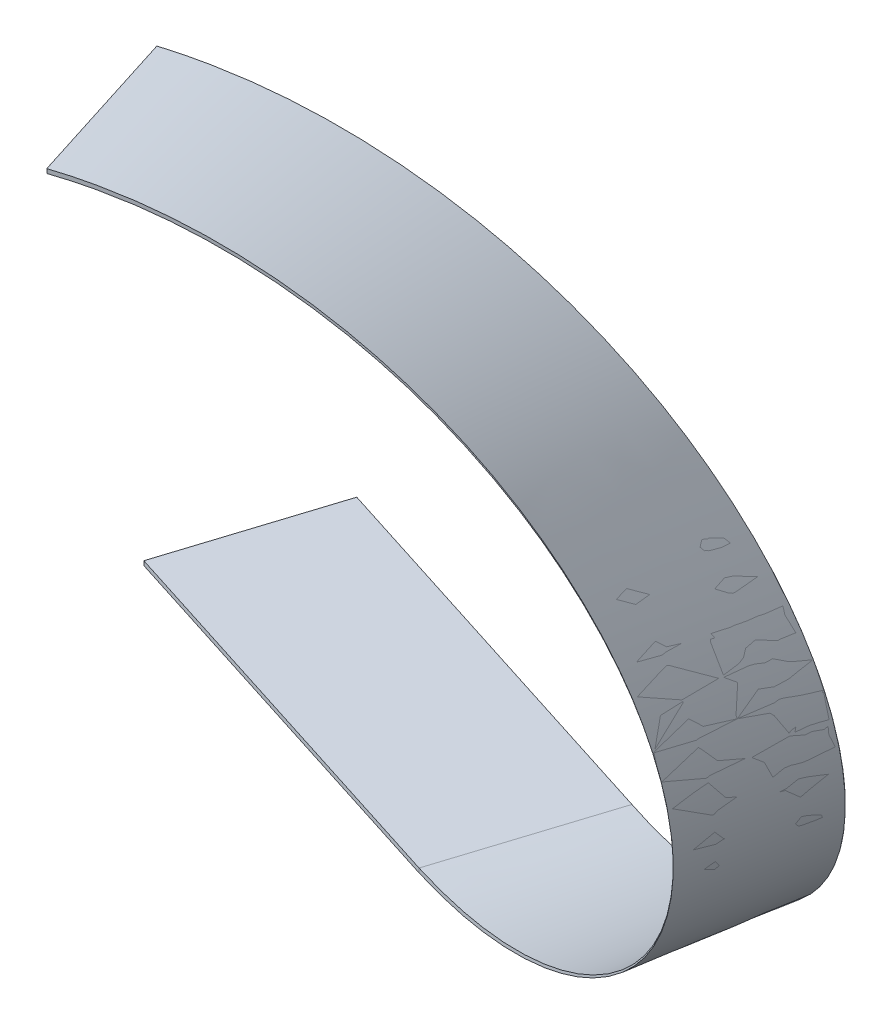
ISO-10303-21;
HEADER;
FILE_DESCRIPTION(('STEP AP214'),'2;1');
FILE_NAME('part.step','',(''),(''),'','','');
FILE_SCHEMA(('AUTOMOTIVE_DESIGN { 1 0 10303 214 1 1 1 1 }'));
ENDSEC;
DATA;
#1=APPLICATION_CONTEXT('core data for automotive mechanical design processes');
#2=APPLICATION_PROTOCOL_DEFINITION('international standard','automotive_design',2000,#1);
#3=PRODUCT_CONTEXT('',#1,'mechanical');
#4=PRODUCT('Part','Part','',(#3));
#5=PRODUCT_RELATED_PRODUCT_CATEGORY('part','',(#4));
#6=PRODUCT_DEFINITION_FORMATION('','',#4);
#7=PRODUCT_DEFINITION_CONTEXT('part definition',#1,'design');
#8=PRODUCT_DEFINITION('design','',#6,#7);
#9=PRODUCT_DEFINITION_SHAPE('','',#8);
#10=(LENGTH_UNIT() NAMED_UNIT(*) SI_UNIT(.MILLI.,.METRE.));
#11=(NAMED_UNIT(*) PLANE_ANGLE_UNIT() SI_UNIT($,.RADIAN.));
#12=(NAMED_UNIT(*) SI_UNIT($,.STERADIAN.) SOLID_ANGLE_UNIT());
#13=UNCERTAINTY_MEASURE_WITH_UNIT(LENGTH_MEASURE(1.E-05),#10,'distance_accuracy_value','');
#14=(GEOMETRIC_REPRESENTATION_CONTEXT(3) GLOBAL_UNCERTAINTY_ASSIGNED_CONTEXT((#13)) GLOBAL_UNIT_ASSIGNED_CONTEXT((#10,
#11,#12)) REPRESENTATION_CONTEXT('',''));
#15=CARTESIAN_POINT('',(0.,0.,0.));
#16=DIRECTION('',(0.,0.,1.));
#17=DIRECTION('',(1.,0.,0.));
#18=AXIS2_PLACEMENT_3D('',#15,#16,#17);
#19=CARTESIAN_POINT('',(3.03338638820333,49.5161988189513,59.5296643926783));
#20=DIRECTION('',(-0.952890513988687,0.,0.303314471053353));
#21=DIRECTION('',(0.303314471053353,0.,0.952890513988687));
#22=AXIS2_PLACEMENT_3D('',#19,#20,#21);
#23=PLANE('',#22);
#24=DIRECTION('',(-0.000491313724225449,0.999998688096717,-0.00154350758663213));
#25=VECTOR('',#24,1.);
#26=CARTESIAN_POINT('',(3.03314073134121,50.0161981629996,59.5288926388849));
#27=LINE('',#26,#25);
#28=CARTESIAN_POINT('',(3.03338638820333,49.5161988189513,59.5296643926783));
#29=VERTEX_POINT('',#28);
#30=CARTESIAN_POINT('',(3.03314073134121,50.0161981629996,59.5288926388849));
#31=VERTEX_POINT('',#30);
#32=EDGE_CURVE('E159',#29,#31,#27,.T.);
#33=ORIENTED_EDGE('',*,*,#32,.T.);
#34=DIRECTION('',(-0.303314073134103,-0.00161981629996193,-0.952889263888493));
#35=VECTOR('',#34,1.);
#36=CARTESIAN_POINT('',(-3.03314073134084,49.9838018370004,40.4711073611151));
#37=LINE('',#36,#35);
#38=CARTESIAN_POINT('',(-3.03314073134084,49.9838018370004,40.4711073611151));
#39=VERTEX_POINT('',#38);
#40=EDGE_CURVE('E152',#31,#39,#37,.T.);
#41=ORIENTED_EDGE('',*,*,#40,.T.);
#42=DIRECTION('',(0.000491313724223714,-0.999998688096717,0.00154350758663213));
#43=VECTOR('',#42,1.);
#44=CARTESIAN_POINT('',(-3.03314073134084,49.9838018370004,40.4711073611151));
#45=LINE('',#44,#43);
#46=CARTESIAN_POINT('',(-3.03289507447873,49.483802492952,40.4718791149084));
#47=VERTEX_POINT('',#46);
#48=EDGE_CURVE('E155',#39,#47,#45,.T.);
#49=ORIENTED_EDGE('',*,*,#48,.T.);
#50=DIRECTION('',(0.303314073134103,0.00161981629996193,0.952889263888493));
#51=VECTOR('',#50,1.);
#52=CARTESIAN_POINT('',(-3.03289507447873,49.483802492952,40.4718791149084));
#53=LINE('',#52,#51);
#54=EDGE_CURVE('E177',#47,#29,#53,.T.);
#55=ORIENTED_EDGE('',*,*,#54,.T.);
#56=EDGE_LOOP('',(#33,#41,#49,#55));
#57=FACE_BOUND('',#56,.T.);
#58=ADVANCED_FACE('F116',(#57),#23,.T.);
#59=CARTESIAN_POINT('',(-3.03314471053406,-50.,9.52890513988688));
#60=CARTESIAN_POINT('',(0.360957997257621,-49.9996625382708,10.5690530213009));
#61=CARTESIAN_POINT('',(10.5679137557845,-49.0317210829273,13.6973871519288));
#62=CARTESIAN_POINT('',(26.6002907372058,-42.6481279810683,18.9035386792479));
#63=CARTESIAN_POINT('',(41.5137708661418,-28.4920823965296,25.1539128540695));
#64=CARTESIAN_POINT('',(49.9303015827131,-10.0013174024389,31.4038977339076));
#65=CARTESIAN_POINT('',(50.6885872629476,10.0175155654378,37.6539000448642));
#66=CARTESIAN_POINT('',(43.7886279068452,28.5082805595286,43.9038849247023));
#67=CARTESIAN_POINT('',(30.391719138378,42.6643261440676,50.154259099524));
#68=CARTESIAN_POINT('',(15.6231516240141,49.0479192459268,55.360410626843));
#69=CARTESIAN_POINT('',(6.17448154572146,50.0158607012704,58.4887447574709));
#70=CARTESIAN_POINT('',(3.03314073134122,50.0161981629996,59.5288926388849));
#71=CARTESIAN_POINT('',(-2.78038265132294,-50.,8.73482971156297));
#72=CARTESIAN_POINT('',(0.603188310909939,-49.9996906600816,9.77497761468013));
#73=CARTESIAN_POINT('',(10.7785488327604,-49.0318335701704,12.9033118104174));
#74=CARTESIAN_POINT('',(26.7582670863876,-42.6483810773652,18.1094634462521));
#75=CARTESIAN_POINT('',(41.6085567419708,-28.492504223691,24.3598377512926));
#76=CARTESIAN_POINT('',(49.9618969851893,-10.0019079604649,30.6098227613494));
#77=CARTESIAN_POINT('',(50.6569921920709,10.0167562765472,36.8598252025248));
#78=CARTESIAN_POINT('',(43.6938423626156,28.5073525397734,43.1098102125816));
#79=CARTESIAN_POINT('',(30.2337431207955,42.6632293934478,49.3601845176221));
#80=CARTESIAN_POINT('',(15.4125168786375,49.0466818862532,54.5663361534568));
#81=CARTESIAN_POINT('',(5.93225156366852,50.0145389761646,57.694670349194));
#82=CARTESIAN_POINT('',(2.78037900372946,50.014848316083,58.7348182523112));
#83=CARTESIAN_POINT('',(-2.27485853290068,-50.,7.14667885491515));
#84=CARTESIAN_POINT('',(1.08764893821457,-49.9997469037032,8.18682680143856));
#85=CARTESIAN_POINT('',(11.1998189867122,-49.0320585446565,11.3151611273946));
#86=CARTESIAN_POINT('',(27.0742197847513,-42.6488872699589,16.5213129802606));
#87=CARTESIAN_POINT('',(41.7981284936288,-28.4933478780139,22.7716875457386));
#88=CARTESIAN_POINT('',(50.0250877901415,-10.003089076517,29.0216728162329));
#89=CARTESIAN_POINT('',(50.5938020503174,10.0152376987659,35.2716755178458));
#90=CARTESIAN_POINT('',(43.5042712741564,28.5054965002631,41.5216607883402));
#91=CARTESIAN_POINT('',(29.9177910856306,42.6610358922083,47.7720353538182));
#92=CARTESIAN_POINT('',(14.9912473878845,49.044207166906,52.9781872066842));
#93=CARTESIAN_POINT('',(5.44779159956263,50.0118955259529,56.1065215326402));
#94=CARTESIAN_POINT('',(2.27485554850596,50.0121486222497,57.1466694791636));
#95=CARTESIAN_POINT('',(-1.5165723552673,-50.,4.76445256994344));
#96=CARTESIAN_POINT('',(1.81433987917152,-49.9998312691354,5.80460058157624));
#97=CARTESIAN_POINT('',(11.8317242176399,-49.0323960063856,8.93293510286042));
#98=CARTESIAN_POINT('',(27.5481488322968,-42.6496465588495,14.1390872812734));
#99=CARTESIAN_POINT('',(42.0824861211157,-28.4946133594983,20.3894622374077));
#100=CARTESIAN_POINT('',(50.1198739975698,-10.0048607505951,26.6394478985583));
#101=CARTESIAN_POINT('',(50.4990168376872,10.0129598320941,32.8894509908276));
#102=CARTESIAN_POINT('',(43.2199146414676,28.5027124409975,39.1394366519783));
#103=CARTESIAN_POINT('',(29.4438630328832,42.6577456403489,45.3898116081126));
#104=CARTESIAN_POINT('',(14.359343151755,49.0404950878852,50.5959637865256));
#105=CARTESIAN_POINT('',(4.7211016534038,50.0079303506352,53.7242983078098));
#106=CARTESIAN_POINT('',(1.5165703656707,50.0080990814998,54.7644463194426));
#107=CARTESIAN_POINT('',(-0.758286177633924,-50.,2.38222628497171));
#108=CARTESIAN_POINT('',(2.54103082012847,-49.9999156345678,3.42237436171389));
#109=CARTESIAN_POINT('',(12.4636294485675,-49.0327334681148,6.55070907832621));
#110=CARTESIAN_POINT('',(28.0220778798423,-42.6504058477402,11.7568615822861));
#111=CARTESIAN_POINT('',(42.3668437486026,-28.4958788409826,18.0072369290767));
#112=CARTESIAN_POINT('',(50.2146602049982,-10.0066324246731,24.2572229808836));
#113=CARTESIAN_POINT('',(50.404231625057,10.0106819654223,30.5072264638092));
#114=CARTESIAN_POINT('',(42.9355580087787,28.4999283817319,36.7572125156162));
#115=CARTESIAN_POINT('',(28.9699349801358,42.6544553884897,43.0075878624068));
#116=CARTESIAN_POINT('',(13.7274389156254,49.0367830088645,48.2137403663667));
#117=CARTESIAN_POINT('',(3.99441170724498,50.0039651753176,51.342075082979));
#118=CARTESIAN_POINT('',(0.758285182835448,50.0040495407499,52.3822231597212));
#119=CARTESIAN_POINT('',(-0.252762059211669,-50.,0.794075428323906));
#120=CARTESIAN_POINT('',(3.02549144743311,-49.9999718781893,1.83422354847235));
#121=CARTESIAN_POINT('',(12.8848996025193,-49.0329584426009,4.96255839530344));
#122=CARTESIAN_POINT('',(28.338030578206,-42.6509120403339,10.1687111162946));
#123=CARTESIAN_POINT('',(42.5564155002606,-28.4967224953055,16.4190867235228));
#124=CARTESIAN_POINT('',(50.2778510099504,-10.0078135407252,22.6690730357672));
#125=CARTESIAN_POINT('',(50.3410414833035,10.0091633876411,28.9190767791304));
#126=CARTESIAN_POINT('',(42.7459869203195,28.4980723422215,35.1690630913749));
#127=CARTESIAN_POINT('',(28.6539829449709,42.6522618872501,41.4194386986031));
#128=CARTESIAN_POINT('',(13.3061694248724,49.0343082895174,46.6255914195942));
#129=CARTESIAN_POINT('',(3.50995174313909,50.0013217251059,49.7539262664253));
#130=CARTESIAN_POINT('',(0.252761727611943,50.0013498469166,50.7940743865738));
#131=CARTESIAN_POINT('',(0.252762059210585,-50.,-0.794075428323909));
#132=CARTESIAN_POINT('',(3.50995207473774,-50.0000281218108,0.246072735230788));
#133=CARTESIAN_POINT('',(13.3061697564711,-49.033183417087,3.37440771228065));
#134=CARTESIAN_POINT('',(28.6539832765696,-42.6514182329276,8.5805606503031));
#135=CARTESIAN_POINT('',(42.7459872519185,-28.4975661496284,14.8309365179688));
#136=CARTESIAN_POINT('',(50.3410418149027,-10.0089946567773,21.0809230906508));
#137=CARTESIAN_POINT('',(50.27785134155,10.0076448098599,27.3309270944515));
#138=CARTESIAN_POINT('',(42.5564158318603,28.4962163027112,33.5809136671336));
#139=CARTESIAN_POINT('',(28.3380309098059,42.6500683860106,39.8312895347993));
#140=CARTESIAN_POINT('',(12.8848999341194,49.0318335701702,45.0374424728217));
#141=CARTESIAN_POINT('',(3.02549177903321,49.9986782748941,48.1657774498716));
#142=CARTESIAN_POINT('',(-0.252761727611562,49.9986501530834,49.2059256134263));
#143=CARTESIAN_POINT('',(0.758286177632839,-50.0000000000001,-2.38222628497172));
#144=CARTESIAN_POINT('',(3.99441270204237,-50.0000843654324,-1.34207807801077));
#145=CARTESIAN_POINT('',(13.7274399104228,-49.0334083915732,1.78625702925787));
#146=CARTESIAN_POINT('',(28.9699359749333,-42.6519244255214,6.99241018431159));
#147=CARTESIAN_POINT('',(42.9355590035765,-28.4984098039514,13.2427863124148));
#148=CARTESIAN_POINT('',(50.4042326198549,-10.0101757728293,19.4927731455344));
#149=CARTESIAN_POINT('',(50.2146611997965,10.0061262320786,25.7427774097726));
#150=CARTESIAN_POINT('',(42.3668447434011,28.4943602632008,31.9927642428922));
#151=CARTESIAN_POINT('',(28.022078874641,42.647874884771,38.2431403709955));
#152=CARTESIAN_POINT('',(12.4636304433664,49.029358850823,43.4492935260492));
#153=CARTESIAN_POINT('',(2.54103181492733,49.9960348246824,46.5776286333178));
#154=CARTESIAN_POINT('',(-0.758285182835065,49.9959504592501,47.6177768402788));
#155=CARTESIAN_POINT('',(1.51657235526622,-50.,-4.76445256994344));
#156=CARTESIAN_POINT('',(4.72110364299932,-50.0001687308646,-3.7243042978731));
#157=CARTESIAN_POINT('',(14.3593451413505,-49.0337458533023,-0.595968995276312));
#158=CARTESIAN_POINT('',(29.4438650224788,-42.652683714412,4.61018448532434));
#159=CARTESIAN_POINT('',(43.2199166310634,-28.4996752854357,10.8605610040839));
#160=CARTESIAN_POINT('',(50.4990188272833,-10.0119474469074,17.1105482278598));
#161=CARTESIAN_POINT('',(50.1198759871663,10.0038483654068,23.3605528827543));
#162=CARTESIAN_POINT('',(42.0824881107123,28.4915762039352,29.6105401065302));
#163=CARTESIAN_POINT('',(27.5481508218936,42.6445846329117,35.8609166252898));
#164=CARTESIAN_POINT('',(11.8317262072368,49.0256467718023,41.0670701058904));
#165=CARTESIAN_POINT('',(1.8143418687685,49.9920696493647,44.1954054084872));
#166=CARTESIAN_POINT('',(-1.51657036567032,49.9919009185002,45.2355536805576));
#167=CARTESIAN_POINT('',(2.2748585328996,-50.,-7.14667885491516));
#168=CARTESIAN_POINT('',(5.44779458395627,-50.0002530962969,-6.10653051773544));
#169=CARTESIAN_POINT('',(14.9912503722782,-49.0340833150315,-2.97819501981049));
#170=CARTESIAN_POINT('',(29.9177940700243,-42.6534430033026,2.22795878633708));
#171=CARTESIAN_POINT('',(43.5042742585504,-28.50094076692,8.47833569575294));
#172=CARTESIAN_POINT('',(50.5938050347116,-10.0137191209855,14.7283233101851));
#173=CARTESIAN_POINT('',(50.025090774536,10.001570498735,20.978328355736));
#174=CARTESIAN_POINT('',(41.7981314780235,28.4887921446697,27.2283159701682));
#175=CARTESIAN_POINT('',(27.0742227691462,42.6412943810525,33.478692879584));
#176=CARTESIAN_POINT('',(11.1998219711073,49.0219346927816,38.6848466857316));
#177=CARTESIAN_POINT('',(1.08765192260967,49.9881044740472,41.8131821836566));
#178=CARTESIAN_POINT('',(-2.27485554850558,49.9878513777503,42.8533305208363));
#179=CARTESIAN_POINT('',(2.78038265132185,-50.,-8.73482971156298));
#180=CARTESIAN_POINT('',(5.93225521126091,-50.0003093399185,-7.694681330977));
#181=CARTESIAN_POINT('',(15.4125205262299,-49.0343082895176,-4.56634570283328));
#182=CARTESIAN_POINT('',(30.233746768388,-42.6539491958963,0.639808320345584));
#183=CARTESIAN_POINT('',(43.6938460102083,-28.5017844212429,6.89018549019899));
#184=CARTESIAN_POINT('',(50.6569958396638,-10.0149002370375,13.1401733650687));
#185=CARTESIAN_POINT('',(49.9619006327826,10.0000519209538,19.3901786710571));
#186=CARTESIAN_POINT('',(41.6085603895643,28.4869361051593,25.6401665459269));
#187=CARTESIAN_POINT('',(26.7582707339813,42.6391008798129,31.8905437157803));
#188=CARTESIAN_POINT('',(10.7785524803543,49.0194599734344,37.0966977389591));
#189=CARTESIAN_POINT('',(0.603191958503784,49.9854610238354,40.2250333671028));
#190=CARTESIAN_POINT('',(-2.78037900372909,49.985151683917,41.2651817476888));
#191=CARTESIAN_POINT('',(3.03314471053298,-50.,-9.52890513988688));
#192=CARTESIAN_POINT('',(6.17448552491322,-50.0003374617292,-8.48875673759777));
#193=CARTESIAN_POINT('',(15.6231556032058,-49.0344207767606,-5.36042104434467));
#194=CARTESIAN_POINT('',(30.3917231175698,-42.6542022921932,-0.154266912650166));
#195=CARTESIAN_POINT('',(43.7886318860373,-28.5022062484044,6.09611038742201));
#196=CARTESIAN_POINT('',(50.68859124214,-10.0154907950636,12.3460983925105));
#197=CARTESIAN_POINT('',(49.9303055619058,9.99929263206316,18.5961038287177));
#198=CARTESIAN_POINT('',(41.5137748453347,28.4860080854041,24.8460918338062));
#199=CARTESIAN_POINT('',(26.6002947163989,42.6380041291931,31.0964691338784));
#200=CARTESIAN_POINT('',(10.5679177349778,49.0182226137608,36.3026232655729));
#201=CARTESIAN_POINT('',(0.360961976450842,49.9841392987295,39.430958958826));
#202=CARTESIAN_POINT('',(-3.03314073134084,49.9838018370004,40.4711073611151));
#203=B_SPLINE_SURFACE_WITH_KNOTS('',3,3,((#59,#60,#61,#62,#63,#64,#65,#66,#67,#68,#69,#70),(#71,
#72,#73,#74,#75,#76,#77,#78,#79,#80,#81,#82),(#83,#84,#85,#86,#87,#88,#89,#90,#91,#92,#93,#94),
(#95,#96,#97,#98,#99,#100,#101,#102,#103,#104,#105,#106),(#107,#108,#109,#110,#111,#112,#113,
#114,#115,#116,#117,#118),(#119,#120,#121,#122,#123,#124,#125,#126,#127,#128,#129,#130),(#131,
#132,#133,#134,#135,#136,#137,#138,#139,#140,#141,#142),(#143,#144,#145,#146,#147,#148,#149,
#150,#151,#152,#153,#154),(#155,#156,#157,#158,#159,#160,#161,#162,#163,#164,#165,#166),(#167,
#168,#169,#170,#171,#172,#173,#174,#175,#176,#177,#178),(#179,#180,#181,#182,#183,#184,#185,
#186,#187,#188,#189,#190),(#191,#192,#193,#194,#195,#196,#197,#198,#199,#200,#201,#202)),
.UNSPECIFIED.,.F.,.F.,.F.,(4,1,1,1,2,1,1,1,4),(4,1,1,1,1,1,1,1,1,4),(0.51219512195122,
0.573170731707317,0.634146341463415,0.695121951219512,0.75609756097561,0.817073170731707,
0.878048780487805,0.939024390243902,1.),(0.,0.0625,0.1875,0.3125,0.4375,0.5625,0.6875,0.8125,
0.9375,1.),.UNSPECIFIED.);
#204=DIRECTION('',(0.303314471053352,0.,-0.952890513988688));
#205=VECTOR('',#204,1.);
#206=CARTESIAN_POINT('',(-3.03314471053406,-50.,9.52890513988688));
#207=LINE('',#206,#205);
#208=CARTESIAN_POINT('',(-3.03314471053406,-50.,9.52890513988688));
#209=VERTEX_POINT('',#208);
#210=CARTESIAN_POINT('',(3.03314471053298,-50.,-9.52890513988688));
#211=VERTEX_POINT('',#210);
#212=EDGE_CURVE('E184',#209,#211,#207,.T.);
#213=CARTESIAN_POINT('',(3.03314471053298,-50.,-9.52890513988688));
#214=CARTESIAN_POINT('',(6.17448552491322,-50.0003374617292,-8.48875673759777));
#215=CARTESIAN_POINT('',(15.6231556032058,-49.0344207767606,-5.36042104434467));
#216=CARTESIAN_POINT('',(30.3917231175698,-42.6542022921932,-0.154266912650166));
#217=CARTESIAN_POINT('',(43.7886318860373,-28.5022062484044,6.09611038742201));
#218=CARTESIAN_POINT('',(50.68859124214,-10.0154907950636,12.3460983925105));
#219=CARTESIAN_POINT('',(49.9303055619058,9.99929263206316,18.5961038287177));
#220=CARTESIAN_POINT('',(41.5137748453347,28.4860080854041,24.8460918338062));
#221=CARTESIAN_POINT('',(26.6002947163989,42.6380041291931,31.0964691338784));
#222=CARTESIAN_POINT('',(10.5679177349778,49.0182226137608,36.3026232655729));
#223=CARTESIAN_POINT('',(0.360961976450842,49.9841392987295,39.430958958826));
#224=CARTESIAN_POINT('',(-3.03314073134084,49.9838018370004,40.4711073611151));
#225=B_SPLINE_CURVE_WITH_KNOTS('',3,(#213,#214,#215,#216,#217,#218,#219,#220,#221,#222,#223,
#224),.UNSPECIFIED.,.F.,.F.,(4,1,1,1,1,1,1,1,1,4),(0.,0.0625,0.1875,0.3125,0.4375,0.5625,0.6875,
0.8125,0.9375,1.),.UNSPECIFIED.);
#226=EDGE_CURVE('E175',#211,#39,#225,.T.);
#227=CARTESIAN_POINT('',(-3.03314471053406,-50.,9.52890513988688));
#228=CARTESIAN_POINT('',(0.360957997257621,-49.9996625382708,10.5690530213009));
#229=CARTESIAN_POINT('',(10.5679137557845,-49.0317210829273,13.6973871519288));
#230=CARTESIAN_POINT('',(26.6002907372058,-42.6481279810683,18.9035386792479));
#231=CARTESIAN_POINT('',(41.5137708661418,-28.4920823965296,25.1539128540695));
#232=CARTESIAN_POINT('',(49.9303015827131,-10.0013174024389,31.4038977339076));
#233=CARTESIAN_POINT('',(50.6885872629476,10.0175155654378,37.6539000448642));
#234=CARTESIAN_POINT('',(43.7886279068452,28.5082805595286,43.9038849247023));
#235=CARTESIAN_POINT('',(30.391719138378,42.6643261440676,50.154259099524));
#236=CARTESIAN_POINT('',(15.6231516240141,49.0479192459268,55.360410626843));
#237=CARTESIAN_POINT('',(6.17448154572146,50.0158607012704,58.4887447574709));
#238=CARTESIAN_POINT('',(3.03314073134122,50.0161981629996,59.5288926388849));
#239=B_SPLINE_CURVE_WITH_KNOTS('',3,(#227,#228,#229,#230,#231,#232,#233,#234,#235,#236,#237,
#238),.UNSPECIFIED.,.F.,.F.,(4,1,1,1,1,1,1,1,1,4),(0.,0.0625,0.1875,0.3125,0.4375,0.5625,0.6875,
0.8125,0.9375,1.),.UNSPECIFIED.);
#240=EDGE_CURVE('E187',#209,#31,#239,.T.);
#241=ORIENTED_EDGE('',*,*,#212,.T.);
#242=ORIENTED_EDGE('',*,*,#226,.T.);
#243=ORIENTED_EDGE('',*,*,#40,.F.);
#244=ORIENTED_EDGE('',*,*,#240,.F.);
#245=EDGE_LOOP('',(#241,#242,#243,#244));
#246=FACE_BOUND('',#245,.T.);
#247=ADVANCED_FACE('F182',(#246),#203,.T.);
#248=CARTESIAN_POINT('',(-3.03314471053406,-49.5,9.52890513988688));
#249=CARTESIAN_POINT('',(0.36096311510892,-49.5204958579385,10.5690690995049));
#250=CARTESIAN_POINT('',(10.5679342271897,-48.615054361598,13.6974514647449));
#251=CARTESIAN_POINT('',(26.6003367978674,-42.3356278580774,18.9036833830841));
#252=CARTESIAN_POINT('',(41.5138476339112,-28.3045821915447,25.15415402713));
#253=CARTESIAN_POINT('',(49.9304090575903,-9.93881711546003,31.4042353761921));
#254=CARTESIAN_POINT('',(50.6887254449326,9.95501593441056,37.654334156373));
#255=CARTESIAN_POINT('',(43.7887967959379,28.3207810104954,43.9044155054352));
#256=CARTESIAN_POINT('',(30.3919187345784,42.3518266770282,50.154886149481));
#257=CARTESIAN_POINT('',(15.623376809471,48.6312531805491,55.3611180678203));
#258=CARTESIAN_POINT('',(6.17472208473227,49.5366946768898,58.4895004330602));
#259=CARTESIAN_POINT('',(3.03338638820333,49.5161988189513,59.5296643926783));
#260=CARTESIAN_POINT('',(-3.03314471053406,-49.5416666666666,9.52890513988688));
#261=CARTESIAN_POINT('',(0.360962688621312,-49.5604264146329,10.5690677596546));
#262=CARTESIAN_POINT('',(10.5679325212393,-48.6497765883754,13.6974461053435));
#263=CARTESIAN_POINT('',(26.6003329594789,-42.3616695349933,18.9036713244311));
#264=CARTESIAN_POINT('',(41.5138412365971,-28.3202072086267,25.1541339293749));
#265=CARTESIAN_POINT('',(49.9304001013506,-9.94402547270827,31.4042072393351));
#266=CARTESIAN_POINT('',(50.6887139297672,9.96022423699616,37.6542979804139));
#267=CARTESIAN_POINT('',(43.7887827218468,28.3364059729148,43.9043712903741));
#268=CARTESIAN_POINT('',(30.3919021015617,42.3778682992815,50.154833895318));
#269=CARTESIAN_POINT('',(15.6233580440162,48.6659753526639,55.3610591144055));
#270=CARTESIAN_POINT('',(6.17470203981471,49.5766251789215,58.4894374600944));
#271=CARTESIAN_POINT('',(3.03336591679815,49.5578654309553,59.5296000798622));
#272=CARTESIAN_POINT('',(-3.03314471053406,-49.625,9.52890513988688));
#273=CARTESIAN_POINT('',(0.360961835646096,-49.6402875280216,10.5690650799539));
#274=CARTESIAN_POINT('',(10.5679291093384,-48.7192210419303,13.6974353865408));
#275=CARTESIAN_POINT('',(26.600325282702,-42.4137528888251,18.903647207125));
#276=CARTESIAN_POINT('',(41.5138284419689,-28.3514572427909,25.1540937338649));
#277=CARTESIAN_POINT('',(49.930382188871,-9.95444218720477,31.404150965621));
#278=CARTESIAN_POINT('',(50.6886908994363,9.97064084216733,37.6542256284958));
#279=CARTESIAN_POINT('',(43.7887545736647,28.3676558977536,43.9042828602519));
#280=CARTESIAN_POINT('',(30.3918688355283,42.4299515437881,50.1547293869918));
#281=CARTESIAN_POINT('',(15.6233205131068,48.7354196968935,55.360941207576));
#282=CARTESIAN_POINT('',(6.17466194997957,49.6564861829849,58.4893115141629));
#283=CARTESIAN_POINT('',(3.0333249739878,49.6411986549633,59.5294714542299));
#284=CARTESIAN_POINT('',(-3.03314471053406,-49.7499999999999,9.52890513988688));
#285=CARTESIAN_POINT('',(0.360960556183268,-49.7600791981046,10.5690610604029));
#286=CARTESIAN_POINT('',(10.5679239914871,-48.8233877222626,13.6974193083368));
#287=CARTESIAN_POINT('',(26.6003137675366,-42.4918779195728,18.903611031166));
#288=CARTESIAN_POINT('',(41.5138092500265,-28.3983322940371,25.1540334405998));
#289=CARTESIAN_POINT('',(49.9303553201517,-9.97006725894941,31.4040665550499));
#290=CARTESIAN_POINT('',(50.6886563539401,9.98626574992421,37.6541171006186));
#291=CARTESIAN_POINT('',(43.7887123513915,28.414530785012,43.9041502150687));
#292=CARTESIAN_POINT('',(30.3918189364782,42.508076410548,50.1545726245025));
#293=CARTESIAN_POINT('',(15.6232642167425,48.839586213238,55.3607643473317));
#294=CARTESIAN_POINT('',(6.17460181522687,49.7762776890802,58.4891225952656));
#295=CARTESIAN_POINT('',(3.03326355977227,49.7661984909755,59.5292785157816));
#296=CARTESIAN_POINT('',(-3.03314471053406,-49.875,9.52890513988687));
#297=CARTESIAN_POINT('',(0.360959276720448,-49.8798708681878,10.5690570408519));
#298=CARTESIAN_POINT('',(10.5679188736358,-48.927554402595,13.6974032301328));
#299=CARTESIAN_POINT('',(26.6003022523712,-42.5700029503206,18.9035748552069));
#300=CARTESIAN_POINT('',(41.5137900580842,-28.4452073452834,25.1539731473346));
#301=CARTESIAN_POINT('',(49.9303284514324,-9.98569233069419,31.4039821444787));
#302=CARTESIAN_POINT('',(50.6886218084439,10.0018906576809,37.6540085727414));
#303=CARTESIAN_POINT('',(43.7886701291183,28.4614056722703,43.9040175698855));
#304=CARTESIAN_POINT('',(30.3917690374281,42.5862012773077,50.1544158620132));
#305=CARTESIAN_POINT('',(15.6232079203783,48.9437527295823,55.3605874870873));
#306=CARTESIAN_POINT('',(6.17454168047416,49.8960691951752,58.4889336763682));
#307=CARTESIAN_POINT('',(3.03320214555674,49.8911983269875,59.5290855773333));
#308=CARTESIAN_POINT('',(-3.03314471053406,-49.9583333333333,9.52890513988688));
#309=CARTESIAN_POINT('',(0.360958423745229,-49.9597319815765,10.5690543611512));
#310=CARTESIAN_POINT('',(10.567915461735,-48.9969988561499,13.6973925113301));
#311=CARTESIAN_POINT('',(26.6002945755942,-42.6220863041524,18.9035507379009));
#312=CARTESIAN_POINT('',(41.5137772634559,-28.4764573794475,25.1539329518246));
#313=CARTESIAN_POINT('',(49.9303105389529,-9.99610904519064,31.4039258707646));
#314=CARTESIAN_POINT('',(50.6885987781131,10.0123072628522,37.6539362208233));
#315=CARTESIAN_POINT('',(43.7886419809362,28.4926555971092,43.9039291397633));
#316=CARTESIAN_POINT('',(30.3917357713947,42.6382845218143,50.1543113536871));
#317=CARTESIAN_POINT('',(15.6231703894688,49.013197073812,55.3604695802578));
#318=CARTESIAN_POINT('',(6.17450159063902,49.9759301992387,58.4888077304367));
#319=CARTESIAN_POINT('',(3.03316120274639,49.9745315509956,59.5289569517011));
#320=CARTESIAN_POINT('',(-3.03314471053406,-50.,9.52890513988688));
#321=CARTESIAN_POINT('',(0.360957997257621,-49.9996625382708,10.5690530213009));
#322=CARTESIAN_POINT('',(10.5679137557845,-49.0317210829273,13.6973871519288));
#323=CARTESIAN_POINT('',(26.6002907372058,-42.6481279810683,18.9035386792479));
#324=CARTESIAN_POINT('',(41.5137708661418,-28.4920823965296,25.1539128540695));
#325=CARTESIAN_POINT('',(49.9303015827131,-10.0013174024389,31.4038977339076));
#326=CARTESIAN_POINT('',(50.6885872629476,10.0175155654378,37.6539000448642));
#327=CARTESIAN_POINT('',(43.7886279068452,28.5082805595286,43.9038849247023));
#328=CARTESIAN_POINT('',(30.391719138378,42.6643261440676,50.154259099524));
#329=CARTESIAN_POINT('',(15.6231516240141,49.0479192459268,55.360410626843));
#330=CARTESIAN_POINT('',(6.17448154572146,50.0158607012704,58.4887447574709));
#331=CARTESIAN_POINT('',(3.03314073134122,50.0161981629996,59.5288926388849));
#332=B_SPLINE_SURFACE_WITH_KNOTS('',3,3,((#248,#249,#250,#251,#252,#253,#254,#255,#256,#257,
#258,#259),(#260,#261,#262,#263,#264,#265,#266,#267,#268,#269,#270,#271),(#272,#273,#274,#275,
#276,#277,#278,#279,#280,#281,#282,#283),(#284,#285,#286,#287,#288,#289,#290,#291,#292,#293,
#294,#295),(#296,#297,#298,#299,#300,#301,#302,#303,#304,#305,#306,#307),(#308,#309,#310,#311,
#312,#313,#314,#315,#316,#317,#318,#319),(#320,#321,#322,#323,#324,#325,#326,#327,#328,#329,
#330,#331)),.UNSPECIFIED.,.F.,.F.,.F.,(4,1,1,1,4),(4,1,1,1,1,1,1,1,1,4),(0.5,0.503048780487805,
0.50609756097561,0.509146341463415,0.51219512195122),(0.,0.0625,0.1875,0.3125,0.4375,0.5625,
0.6875,0.8125,0.9375,1.),.UNSPECIFIED.);
#333=DIRECTION('',(0.,-1.,0.));
#334=VECTOR('',#333,1.);
#335=CARTESIAN_POINT('',(-3.03314471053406,-49.5,9.52890513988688));
#336=LINE('',#335,#334);
#337=CARTESIAN_POINT('',(-3.03314471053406,-49.5,9.52890513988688));
#338=VERTEX_POINT('',#337);
#339=EDGE_CURVE('E120',#338,#209,#336,.T.);
#340=CARTESIAN_POINT('',(-3.03314471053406,-49.5,9.52890513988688));
#341=CARTESIAN_POINT('',(0.36096311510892,-49.5204958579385,10.5690690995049));
#342=CARTESIAN_POINT('',(10.5679342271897,-48.615054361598,13.6974514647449));
#343=CARTESIAN_POINT('',(26.6003367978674,-42.3356278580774,18.9036833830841));
#344=CARTESIAN_POINT('',(41.5138476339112,-28.3045821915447,25.15415402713));
#345=CARTESIAN_POINT('',(49.9304090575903,-9.93881711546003,31.4042353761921));
#346=CARTESIAN_POINT('',(50.6887254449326,9.95501593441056,37.654334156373));
#347=CARTESIAN_POINT('',(43.7887967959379,28.3207810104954,43.9044155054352));
#348=CARTESIAN_POINT('',(30.3919187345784,42.3518266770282,50.154886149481));
#349=CARTESIAN_POINT('',(15.623376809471,48.6312531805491,55.3611180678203));
#350=CARTESIAN_POINT('',(6.17472208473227,49.5366946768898,58.4895004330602));
#351=CARTESIAN_POINT('',(3.03338638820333,49.5161988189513,59.5296643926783));
#352=B_SPLINE_CURVE_WITH_KNOTS('',3,(#340,#341,#342,#343,#344,#345,#346,#347,#348,#349,#350,
#351),.UNSPECIFIED.,.F.,.F.,(4,1,1,1,1,1,1,1,1,4),(0.,0.0625,0.1875,0.3125,0.4375,0.5625,0.6875,
0.8125,0.9375,1.),.UNSPECIFIED.);
#353=EDGE_CURVE('E190',#338,#29,#352,.T.);
#354=ORIENTED_EDGE('',*,*,#339,.T.);
#355=ORIENTED_EDGE('',*,*,#240,.T.);
#356=ORIENTED_EDGE('',*,*,#32,.F.);
#357=ORIENTED_EDGE('',*,*,#353,.F.);
#358=EDGE_LOOP('',(#354,#355,#356,#357));
#359=FACE_BOUND('',#358,.T.);
#360=ADVANCED_FACE('F260',(#359),#332,.T.);
#361=CARTESIAN_POINT('',(3.03314471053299,-49.5,-9.52890513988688));
#362=CARTESIAN_POINT('',(6.17449064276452,-49.5211707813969,-8.48874065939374));
#363=CARTESIAN_POINT('',(15.623176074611,-48.6177540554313,-5.36035673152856));
#364=CARTESIAN_POINT('',(30.3917691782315,-42.3417021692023,-0.154122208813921));
#365=CARTESIAN_POINT('',(43.7887086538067,-28.3147060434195,6.09635156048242));
#366=CARTESIAN_POINT('',(50.6886987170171,-9.95299050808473,12.3464360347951));
#367=CARTESIAN_POINT('',(49.9304437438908,9.93679300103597,18.5965379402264));
#368=CARTESIAN_POINT('',(41.5139437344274,28.2985085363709,24.8466224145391));
#369=CARTESIAN_POINT('',(26.6004943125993,42.3255046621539,31.0970961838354));
#370=CARTESIAN_POINT('',(10.5681429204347,48.6015565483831,36.3033307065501));
#371=CARTESIAN_POINT('',(0.36120251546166,49.5049732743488,39.4317146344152));
#372=CARTESIAN_POINT('',(-3.03289507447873,49.483802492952,40.4718791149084));
#373=CARTESIAN_POINT('',(2.52762059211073,-49.5,-7.94075428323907));
#374=CARTESIAN_POINT('',(5.69003001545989,-49.5211145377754,-6.90058984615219));
#375=CARTESIAN_POINT('',(15.2019059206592,-48.6175290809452,-3.77220604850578));
#376=CARTESIAN_POINT('',(30.0758164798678,-42.3411959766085,1.43402825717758));
#377=CARTESIAN_POINT('',(43.5991369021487,-28.3138623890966,7.68450176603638));
#378=CARTESIAN_POINT('',(50.6255079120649,-9.95180939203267,13.9345859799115));
#379=CARTESIAN_POINT('',(49.9936338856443,9.93831157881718,20.1846876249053));
#380=CARTESIAN_POINT('',(41.7035148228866,28.3003645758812,26.4347718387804));
#381=CARTESIAN_POINT('',(26.9164463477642,42.3276981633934,32.6852453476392));
#382=CARTESIAN_POINT('',(10.9894124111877,48.6040312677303,37.8914796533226));
#383=CARTESIAN_POINT('',(0.845662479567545,49.5076167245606,41.019863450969));
#384=CARTESIAN_POINT('',(-2.52737161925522,49.4865021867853,42.0600278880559));
#385=CARTESIAN_POINT('',(1.51657235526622,-49.5,-4.76445256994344));
#386=CARTESIAN_POINT('',(4.72110876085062,-49.5210020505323,-3.72428821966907));
#387=CARTESIAN_POINT('',(14.3593656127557,-48.617079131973,-0.595904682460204));
#388=CARTESIAN_POINT('',(29.4439110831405,-42.340183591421,4.61032918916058));
#389=CARTESIAN_POINT('',(43.2199933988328,-28.3121750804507,10.8608021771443));
#390=CARTESIAN_POINT('',(50.4991263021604,-9.94944715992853,17.1108858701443));
#391=CARTESIAN_POINT('',(50.1200141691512,9.94134873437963,23.360986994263));
#392=CARTESIAN_POINT('',(42.082656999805,28.304076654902,29.6110706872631));
#393=CARTESIAN_POINT('',(27.5483504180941,42.3320851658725,35.8615436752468));
#394=CARTESIAN_POINT('',(11.8319513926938,48.6089807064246,41.0677775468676));
#395=CARTESIAN_POINT('',(1.81458240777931,49.5129036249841,44.1961610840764));
#396=CARTESIAN_POINT('',(-1.51632470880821,49.4919015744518,45.2363254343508));
#397=CARTESIAN_POINT('',(-5.3624639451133E-13,-49.5000000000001,0.));
#398=CARTESIAN_POINT('',(3.26772687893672,-49.5208333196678,1.04016422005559));
#399=CARTESIAN_POINT('',(13.0955551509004,-48.6164042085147,4.16854736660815));
#400=CARTESIAN_POINT('',(28.4960529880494,-42.3386650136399,9.37478058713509));
#401=CARTESIAN_POINT('',(42.651278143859,-28.3096441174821,15.6252527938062));
#402=CARTESIAN_POINT('',(50.3095538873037,-9.94590381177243,21.8753357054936));
#403=CARTESIAN_POINT('',(50.3095845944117,9.94590446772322,28.1254360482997));
#404=CARTESIAN_POINT('',(42.6513702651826,28.3096447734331,34.3755189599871));
#405=CARTESIAN_POINT('',(28.4962065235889,42.338665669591,40.6259911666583));
#406=CARTESIAN_POINT('',(13.0957598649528,48.6164048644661,45.8322243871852));
#407=CARTESIAN_POINT('',(3.26796230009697,49.5208339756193,48.9606075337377));
#408=CARTESIAN_POINT('',(0.000245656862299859,49.5000006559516,50.0007717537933));
#409=CARTESIAN_POINT('',(-1.5165723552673,-49.4999999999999,4.76445256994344));
#410=CARTESIAN_POINT('',(1.81434499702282,-49.5206645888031,5.80461665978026));
#411=CARTESIAN_POINT('',(11.831744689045,-48.6157292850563,8.93299941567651));
#412=CARTESIAN_POINT('',(27.5481948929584,-42.3371464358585,14.1392319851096));
#413=CARTESIAN_POINT('',(42.0825628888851,-28.3071131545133,20.3897034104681));
#414=CARTESIAN_POINT('',(50.119981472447,-9.94236046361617,26.6397855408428));
#415=CARTESIAN_POINT('',(50.4991550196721,9.95046020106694,32.8898851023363));
#416=CARTESIAN_POINT('',(43.2200835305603,28.3152128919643,39.1399672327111));
#417=CARTESIAN_POINT('',(29.4440626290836,42.3452461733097,45.3904386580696));
#418=CARTESIAN_POINT('',(14.3595683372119,48.6238290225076,50.5966712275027));
#419=CARTESIAN_POINT('',(4.72134219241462,49.5287643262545,53.7250539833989));
#420=CARTESIAN_POINT('',(1.51681602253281,49.5080997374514,54.7652180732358));
#421=CARTESIAN_POINT('',(-2.5276205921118,-49.5,7.94075428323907));
#422=CARTESIAN_POINT('',(0.845423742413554,-49.5205521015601,8.98091828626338));
#423=CARTESIAN_POINT('',(10.9892043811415,-48.6152793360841,12.1093007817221));
#424=CARTESIAN_POINT('',(26.9162894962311,-42.3361340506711,17.3155329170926));
#425=CARTESIAN_POINT('',(41.7034193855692,-28.3054258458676,23.566003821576));
#426=CARTESIAN_POINT('',(49.9935998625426,-9.93999823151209,29.8160854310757));
#427=CARTESIAN_POINT('',(50.6255353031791,9.95349735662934,36.0661844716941));
#428=CARTESIAN_POINT('',(43.5992257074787,28.318924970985,42.3162660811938));
#429=CARTESIAN_POINT('',(30.0759666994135,42.3496331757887,48.5667369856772));
#430=CARTESIAN_POINT('',(15.202107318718,48.6287784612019,53.7729691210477));
#431=CARTESIAN_POINT('',(5.69026212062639,49.534051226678,56.9013516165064));
#432=CARTESIAN_POINT('',(2.52786293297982,49.513499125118,57.9415156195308));
#433=CARTESIAN_POINT('',(-3.03314471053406,-49.5,9.52890513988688));
#434=CARTESIAN_POINT('',(0.36096311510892,-49.5204958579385,10.5690690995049));
#435=CARTESIAN_POINT('',(10.5679342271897,-48.615054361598,13.6974514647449));
#436=CARTESIAN_POINT('',(26.6003367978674,-42.3356278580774,18.9036833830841));
#437=CARTESIAN_POINT('',(41.5138476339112,-28.3045821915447,25.15415402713));
#438=CARTESIAN_POINT('',(49.9304090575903,-9.93881711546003,31.4042353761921));
#439=CARTESIAN_POINT('',(50.6887254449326,9.95501593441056,37.654334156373));
#440=CARTESIAN_POINT('',(43.7887967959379,28.3207810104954,43.9044155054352));
#441=CARTESIAN_POINT('',(30.3919187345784,42.3518266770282,50.154886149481));
#442=CARTESIAN_POINT('',(15.623376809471,48.6312531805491,55.3611180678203));
#443=CARTESIAN_POINT('',(6.17472208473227,49.5366946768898,58.4895004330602));
#444=CARTESIAN_POINT('',(3.03338638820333,49.5161988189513,59.5296643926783));
#445=B_SPLINE_SURFACE_WITH_KNOTS('',3,3,((#361,#362,#363,#364,#365,#366,#367,#368,#369,#370,
#371,#372),(#373,#374,#375,#376,#377,#378,#379,#380,#381,#382,#383,#384),(#385,#386,#387,#388,
#389,#390,#391,#392,#393,#394,#395,#396),(#397,#398,#399,#400,#401,#402,#403,#404,#405,#406,
#407,#408),(#409,#410,#411,#412,#413,#414,#415,#416,#417,#418,#419,#420),(#421,#422,#423,#424,
#425,#426,#427,#428,#429,#430,#431,#432),(#433,#434,#435,#436,#437,#438,#439,#440,#441,#442,
#443,#444)),.UNSPECIFIED.,.F.,.F.,.F.,(4,1,1,1,4),(4,1,1,1,1,1,1,1,1,4),(0.0121951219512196,
0.134146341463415,0.25609756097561,0.378048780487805,0.5),(0.,0.0625,0.1875,0.3125,0.4375,
0.5625,0.6875,0.8125,0.9375,1.),.UNSPECIFIED.);
#446=DIRECTION('',(-0.303314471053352,0.,0.952890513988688));
#447=VECTOR('',#446,1.);
#448=CARTESIAN_POINT('',(-3.03314471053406,-49.5,9.52890513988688));
#449=LINE('',#448,#447);
#450=CARTESIAN_POINT('',(3.03314471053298,-49.5,-9.52890513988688));
#451=VERTEX_POINT('',#450);
#452=EDGE_CURVE('E13',#451,#338,#449,.T.);
#453=CARTESIAN_POINT('',(3.03314471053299,-49.5,-9.52890513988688));
#454=CARTESIAN_POINT('',(6.17449064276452,-49.5211707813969,-8.48874065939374));
#455=CARTESIAN_POINT('',(15.623176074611,-48.6177540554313,-5.36035673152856));
#456=CARTESIAN_POINT('',(30.3917691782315,-42.3417021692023,-0.154122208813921));
#457=CARTESIAN_POINT('',(43.7887086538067,-28.3147060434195,6.09635156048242));
#458=CARTESIAN_POINT('',(50.6886987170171,-9.95299050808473,12.3464360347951));
#459=CARTESIAN_POINT('',(49.9304437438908,9.93679300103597,18.5965379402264));
#460=CARTESIAN_POINT('',(41.5139437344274,28.2985085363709,24.8466224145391));
#461=CARTESIAN_POINT('',(26.6004943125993,42.3255046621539,31.0970961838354));
#462=CARTESIAN_POINT('',(10.5681429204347,48.6015565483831,36.3033307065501));
#463=CARTESIAN_POINT('',(0.36120251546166,49.5049732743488,39.4317146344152));
#464=CARTESIAN_POINT('',(-3.03289507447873,49.483802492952,40.4718791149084));
#465=B_SPLINE_CURVE_WITH_KNOTS('',3,(#453,#454,#455,#456,#457,#458,#459,#460,#461,#462,#463,
#464),.UNSPECIFIED.,.F.,.F.,(4,1,1,1,1,1,1,1,1,4),(0.,0.0625,0.1875,0.3125,0.4375,0.5625,0.6875,
0.8125,0.9375,1.),.UNSPECIFIED.);
#466=EDGE_CURVE('E165',#451,#47,#465,.T.);
#467=ORIENTED_EDGE('',*,*,#452,.T.);
#468=ORIENTED_EDGE('',*,*,#353,.T.);
#469=ORIENTED_EDGE('',*,*,#54,.F.);
#470=ORIENTED_EDGE('',*,*,#466,.F.);
#471=EDGE_LOOP('',(#467,#468,#469,#470));
#472=FACE_BOUND('',#471,.T.);
#473=ADVANCED_FACE('F221',(#472),#445,.T.);
#474=CARTESIAN_POINT('',(3.03314471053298,-50.,-9.52890513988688));
#475=CARTESIAN_POINT('',(6.17448552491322,-50.0003374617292,-8.48875673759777));
#476=CARTESIAN_POINT('',(15.6231556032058,-49.0344207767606,-5.36042104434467));
#477=CARTESIAN_POINT('',(30.3917231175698,-42.6542022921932,-0.154266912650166));
#478=CARTESIAN_POINT('',(43.7886318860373,-28.5022062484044,6.09611038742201));
#479=CARTESIAN_POINT('',(50.68859124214,-10.0154907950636,12.3460983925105));
#480=CARTESIAN_POINT('',(49.9303055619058,9.99929263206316,18.5961038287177));
#481=CARTESIAN_POINT('',(41.5137748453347,28.4860080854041,24.8460918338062));
#482=CARTESIAN_POINT('',(26.6002947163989,42.6380041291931,31.0964691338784));
#483=CARTESIAN_POINT('',(10.5679177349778,49.0182226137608,36.3026232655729));
#484=CARTESIAN_POINT('',(0.360961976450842,49.9841392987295,39.430958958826));
#485=CARTESIAN_POINT('',(-3.03314073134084,49.9838018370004,40.4711073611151));
#486=CARTESIAN_POINT('',(3.03314471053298,-49.9583333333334,-9.52890513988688));
#487=CARTESIAN_POINT('',(6.17448595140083,-49.9604069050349,-8.48875539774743));
#488=CARTESIAN_POINT('',(15.6231573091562,-48.9996985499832,-5.36041568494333));
#489=CARTESIAN_POINT('',(30.3917269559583,-42.6281606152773,-0.154254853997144));
#490=CARTESIAN_POINT('',(43.7886382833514,-28.4865812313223,6.09613048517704));
#491=CARTESIAN_POINT('',(50.6886001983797,-10.0102824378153,12.3461265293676));
#492=CARTESIAN_POINT('',(49.9303170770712,9.99408432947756,18.5961400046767));
#493=CARTESIAN_POINT('',(41.5137889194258,28.4703831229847,24.8461360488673));
#494=CARTESIAN_POINT('',(26.6003113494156,42.6119625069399,31.0965213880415));
#495=CARTESIAN_POINT('',(10.5679365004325,48.983500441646,36.3026822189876));
#496=CARTESIAN_POINT('',(0.360982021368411,49.9442087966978,39.4310219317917));
#497=CARTESIAN_POINT('',(-3.03312025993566,49.9421352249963,40.4711716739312));
#498=CARTESIAN_POINT('',(3.03314471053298,-49.875,-9.52890513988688));
#499=CARTESIAN_POINT('',(6.17448680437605,-49.8805457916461,-8.48875271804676));
#500=CARTESIAN_POINT('',(15.6231607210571,-48.9302540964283,-5.36040496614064));
#501=CARTESIAN_POINT('',(30.3917346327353,-42.5760772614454,-0.154230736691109));
#502=CARTESIAN_POINT('',(43.7886510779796,-28.4553311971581,6.0961706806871));
#503=CARTESIAN_POINT('',(50.6886181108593,-9.99986572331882,12.3461828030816));
#504=CARTESIAN_POINT('',(49.9303401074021,9.98366772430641,18.5962123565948));
#505=CARTESIAN_POINT('',(41.5138170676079,28.4391331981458,24.8462244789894));
#506=CARTESIAN_POINT('',(26.600344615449,42.5598792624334,31.0966258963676));
#507=CARTESIAN_POINT('',(10.567974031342,48.9140560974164,36.3028001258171));
#508=CARTESIAN_POINT('',(0.36102211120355,49.8643477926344,39.4311478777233));
#509=CARTESIAN_POINT('',(-3.03307931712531,49.8588020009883,40.4713002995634));
#510=CARTESIAN_POINT('',(3.03314471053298,-49.7500000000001,-9.52890513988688));
#511=CARTESIAN_POINT('',(6.17448808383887,-49.7607541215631,-8.48874869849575));
#512=CARTESIAN_POINT('',(15.6231658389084,-48.826087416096,-5.36038888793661));
#513=CARTESIAN_POINT('',(30.3917461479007,-42.4979522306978,-0.154194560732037));
#514=CARTESIAN_POINT('',(43.788670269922,-28.408456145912,6.09623097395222));
#515=CARTESIAN_POINT('',(50.6886449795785,-9.98424065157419,12.3462672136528));
#516=CARTESIAN_POINT('',(49.9303746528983,9.96804281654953,18.596320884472));
#517=CARTESIAN_POINT('',(41.5138592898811,28.3922583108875,24.8463571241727));
#518=CARTESIAN_POINT('',(26.6003945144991,42.4817543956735,31.0967826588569));
#519=CARTESIAN_POINT('',(10.5680303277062,48.8098895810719,36.3029769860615));
#520=CARTESIAN_POINT('',(0.361082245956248,49.7445562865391,39.4313367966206));
#521=CARTESIAN_POINT('',(-3.03301790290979,49.7338021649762,40.4714932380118));
#522=CARTESIAN_POINT('',(3.03314471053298,-49.625,-9.52890513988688));
#523=CARTESIAN_POINT('',(6.1744893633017,-49.64096245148,-8.48874467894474));
#524=CARTESIAN_POINT('',(15.6231709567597,-48.7219207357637,-5.36037280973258));
#525=CARTESIAN_POINT('',(30.3917576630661,-42.41982719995,-0.154158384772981));
#526=CARTESIAN_POINT('',(43.7886894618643,-28.3615810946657,6.09629126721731));
#527=CARTESIAN_POINT('',(50.6886718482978,-9.96861557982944,12.3463516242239));
#528=CARTESIAN_POINT('',(49.9304091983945,9.95241790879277,18.5964294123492));
#529=CARTESIAN_POINT('',(41.5139015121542,28.3453834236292,24.8464897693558));
#530=CARTESIAN_POINT('',(26.6004444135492,42.4036295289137,31.0969394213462));
#531=CARTESIAN_POINT('',(10.5680866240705,48.7057230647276,36.3031538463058));
#532=CARTESIAN_POINT('',(0.361142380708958,49.624764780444,39.4315257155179));
#533=CARTESIAN_POINT('',(-3.03295648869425,49.6088023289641,40.47168617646));
#534=CARTESIAN_POINT('',(3.03314471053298,-49.5416666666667,-9.52890513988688));
#535=CARTESIAN_POINT('',(6.17449021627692,-49.5611013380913,-8.48874199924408));
#536=CARTESIAN_POINT('',(15.6231743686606,-48.6524762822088,-5.3603620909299));
#537=CARTESIAN_POINT('',(30.391765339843,-42.3677438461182,-0.154134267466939));
#538=CARTESIAN_POINT('',(43.7887022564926,-28.3303310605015,6.09633146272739));
#539=CARTESIAN_POINT('',(50.6886897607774,-9.95819886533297,12.346407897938));
#540=CARTESIAN_POINT('',(49.9304322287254,9.94200130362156,18.5965017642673));
#541=CARTESIAN_POINT('',(41.5139296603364,28.3141334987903,24.846578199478));
#542=CARTESIAN_POINT('',(26.6004776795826,42.3515462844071,31.0970439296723));
#543=CARTESIAN_POINT('',(10.5681241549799,48.6362787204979,36.3032717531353));
#544=CARTESIAN_POINT('',(0.361182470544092,49.5449037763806,39.4316516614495));
#545=CARTESIAN_POINT('',(-3.0329155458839,49.525469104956,40.4718148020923));
#546=CARTESIAN_POINT('',(3.03314471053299,-49.5,-9.52890513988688));
#547=CARTESIAN_POINT('',(6.17449064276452,-49.5211707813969,-8.48874065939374));
#548=CARTESIAN_POINT('',(15.623176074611,-48.6177540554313,-5.36035673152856));
#549=CARTESIAN_POINT('',(30.3917691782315,-42.3417021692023,-0.154122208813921));
#550=CARTESIAN_POINT('',(43.7887086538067,-28.3147060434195,6.09635156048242));
#551=CARTESIAN_POINT('',(50.6886987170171,-9.95299050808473,12.3464360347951));
#552=CARTESIAN_POINT('',(49.9304437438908,9.93679300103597,18.5965379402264));
#553=CARTESIAN_POINT('',(41.5139437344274,28.2985085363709,24.8466224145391));
#554=CARTESIAN_POINT('',(26.6004943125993,42.3255046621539,31.0970961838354));
#555=CARTESIAN_POINT('',(10.5681429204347,48.6015565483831,36.3033307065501));
#556=CARTESIAN_POINT('',(0.36120251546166,49.5049732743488,39.4317146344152));
#557=CARTESIAN_POINT('',(-3.03289507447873,49.483802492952,40.4718791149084));
#558=B_SPLINE_SURFACE_WITH_KNOTS('',3,3,((#474,#475,#476,#477,#478,#479,#480,#481,#482,#483,
#484,#485),(#486,#487,#488,#489,#490,#491,#492,#493,#494,#495,#496,#497),(#498,#499,#500,#501,
#502,#503,#504,#505,#506,#507,#508,#509),(#510,#511,#512,#513,#514,#515,#516,#517,#518,#519,
#520,#521),(#522,#523,#524,#525,#526,#527,#528,#529,#530,#531,#532,#533),(#534,#535,#536,#537,
#538,#539,#540,#541,#542,#543,#544,#545),(#546,#547,#548,#549,#550,#551,#552,#553,#554,#555,
#556,#557)),.UNSPECIFIED.,.F.,.F.,.F.,(4,1,1,1,4),(4,1,1,1,1,1,1,1,1,4),(0.,0.00304878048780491,
0.00609756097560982,0.0091463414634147,0.0121951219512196),(0.,0.0625,0.1875,0.3125,0.4375,
0.5625,0.6875,0.8125,0.9375,1.),.UNSPECIFIED.);
#559=DIRECTION('',(0.,1.,0.));
#560=VECTOR('',#559,1.);
#561=CARTESIAN_POINT('',(3.03314471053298,-49.5,-9.52890513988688));
#562=LINE('',#561,#560);
#563=EDGE_CURVE('E186',#211,#451,#562,.T.);
#564=ORIENTED_EDGE('',*,*,#563,.T.);
#565=ORIENTED_EDGE('',*,*,#466,.T.);
#566=ORIENTED_EDGE('',*,*,#48,.F.);
#567=ORIENTED_EDGE('',*,*,#226,.F.);
#568=EDGE_LOOP('',(#564,#565,#566,#567));
#569=FACE_BOUND('',#568,.T.);
#570=ADVANCED_FACE('F174',(#569),#558,.T.);
#571=CARTESIAN_POINT('',(-44.6113809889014,-49.4999999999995,-24.6946286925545));
#572=DIRECTION('',(0.303314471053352,0.,-0.952890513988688));
#573=DIRECTION('',(-0.952890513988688,0.,-0.303314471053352));
#574=AXIS2_PLACEMENT_3D('',#571,#572,#573);
#575=PLANE('',#574);
#576=ORIENTED_EDGE('',*,*,#563,.F.);
#577=DIRECTION('',(0.952890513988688,0.,0.303314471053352));
#578=VECTOR('',#577,1.);
#579=CARTESIAN_POINT('',(-44.6113809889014,-49.9999999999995,-24.6946286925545));
#580=LINE('',#579,#578);
#581=CARTESIAN_POINT('',(-44.6113809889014,-49.9999999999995,-24.6946286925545));
#582=VERTEX_POINT('',#581);
#583=EDGE_CURVE('E342',#582,#211,#580,.T.);
#584=ORIENTED_EDGE('',*,*,#583,.F.);
#585=DIRECTION('',(0.,1.,0.));
#586=VECTOR('',#585,1.);
#587=CARTESIAN_POINT('',(-44.6113809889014,-49.4999999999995,-24.6946286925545));
#588=LINE('',#587,#586);
#589=CARTESIAN_POINT('',(-44.6113809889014,-49.4999999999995,-24.6946286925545));
#590=VERTEX_POINT('',#589);
#591=EDGE_CURVE('E333',#582,#590,#588,.T.);
#592=ORIENTED_EDGE('',*,*,#591,.T.);
#593=DIRECTION('',(0.952890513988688,0.,0.303314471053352));
#594=VECTOR('',#593,1.);
#595=CARTESIAN_POINT('',(-44.6113809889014,-49.4999999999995,-24.6946286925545));
#596=LINE('',#595,#594);
#597=EDGE_CURVE('E326',#590,#451,#596,.T.);
#598=ORIENTED_EDGE('',*,*,#597,.T.);
#599=EDGE_LOOP('',(#576,#584,#592,#598));
#600=FACE_BOUND('',#599,.T.);
#601=ADVANCED_FACE('F220',(#600),#575,.T.);
#602=CARTESIAN_POINT('',(-50.6776704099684,-49.9999999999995,-5.63681841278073));
#603=DIRECTION('',(0.,-1.,0.));
#604=DIRECTION('',(1.,0.,0.));
#605=AXIS2_PLACEMENT_3D('',#602,#603,#604);
#606=PLANE('',#605);
#607=ORIENTED_EDGE('',*,*,#212,.F.);
#608=DIRECTION('',(0.952890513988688,0.,0.303314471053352));
#609=VECTOR('',#608,1.);
#610=CARTESIAN_POINT('',(-50.6776704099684,-49.9999999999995,-5.63681841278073));
#611=LINE('',#610,#609);
#612=CARTESIAN_POINT('',(-50.6776704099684,-49.9999999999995,-5.63681841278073));
#613=VERTEX_POINT('',#612);
#614=EDGE_CURVE('E355',#613,#209,#611,.T.);
#615=ORIENTED_EDGE('',*,*,#614,.F.);
#616=DIRECTION('',(0.303314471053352,0.,-0.952890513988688));
#617=VECTOR('',#616,1.);
#618=CARTESIAN_POINT('',(-50.6776704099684,-49.9999999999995,-5.63681841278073));
#619=LINE('',#618,#617);
#620=EDGE_CURVE('E323',#613,#582,#619,.T.);
#621=ORIENTED_EDGE('',*,*,#620,.T.);
#622=ORIENTED_EDGE('',*,*,#583,.T.);
#623=EDGE_LOOP('',(#607,#615,#621,#622));
#624=FACE_BOUND('',#623,.T.);
#625=ADVANCED_FACE('F354',(#624),#606,.T.);
#626=CARTESIAN_POINT('',(-50.6776704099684,-49.4999999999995,-5.63681841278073));
#627=DIRECTION('',(-0.303314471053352,0.,0.952890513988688));
#628=DIRECTION('',(0.952890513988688,0.,0.303314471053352));
#629=AXIS2_PLACEMENT_3D('',#626,#627,#628);
#630=PLANE('',#629);
#631=ORIENTED_EDGE('',*,*,#339,.F.);
#632=DIRECTION('',(0.952890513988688,0.,0.303314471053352));
#633=VECTOR('',#632,1.);
#634=CARTESIAN_POINT('',(-50.6776704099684,-49.4999999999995,-5.63681841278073));
#635=LINE('',#634,#633);
#636=CARTESIAN_POINT('',(-50.6776704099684,-49.4999999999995,-5.63681841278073));
#637=VERTEX_POINT('',#636);
#638=EDGE_CURVE('E358',#637,#338,#635,.T.);
#639=ORIENTED_EDGE('',*,*,#638,.F.);
#640=DIRECTION('',(0.,-1.,0.));
#641=VECTOR('',#640,1.);
#642=CARTESIAN_POINT('',(-50.6776704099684,-49.4999999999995,-5.63681841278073));
#643=LINE('',#642,#641);
#644=EDGE_CURVE('E327',#637,#613,#643,.T.);
#645=ORIENTED_EDGE('',*,*,#644,.T.);
#646=ORIENTED_EDGE('',*,*,#614,.T.);
#647=EDGE_LOOP('',(#631,#639,#645,#646));
#648=FACE_BOUND('',#647,.T.);
#649=ADVANCED_FACE('F360',(#648),#630,.T.);
#650=CARTESIAN_POINT('',(-50.6776704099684,-49.4999999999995,-5.63681841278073));
#651=DIRECTION('',(0.,1.,0.));
#652=DIRECTION('',(-1.,0.,0.));
#653=AXIS2_PLACEMENT_3D('',#650,#651,#652);
#654=PLANE('',#653);
#655=ORIENTED_EDGE('',*,*,#452,.F.);
#656=ORIENTED_EDGE('',*,*,#597,.F.);
#657=DIRECTION('',(-0.303314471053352,0.,0.952890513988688));
#658=VECTOR('',#657,1.);
#659=CARTESIAN_POINT('',(-50.6776704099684,-49.4999999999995,-5.63681841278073));
#660=LINE('',#659,#658);
#661=EDGE_CURVE('E330',#590,#637,#660,.T.);
#662=ORIENTED_EDGE('',*,*,#661,.T.);
#663=ORIENTED_EDGE('',*,*,#638,.T.);
#664=EDGE_LOOP('',(#655,#656,#662,#663));
#665=FACE_BOUND('',#664,.T.);
#666=ADVANCED_FACE('F363',(#665),#654,.T.);
#667=CARTESIAN_POINT('',(-44.6113809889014,-49.9999999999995,-24.6946286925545));
#668=DIRECTION('',(0.952890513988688,0.,0.303314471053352));
#669=DIRECTION('',(0.303314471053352,0.,-0.952890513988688));
#670=AXIS2_PLACEMENT_3D('',#667,#668,#669);
#671=PLANE('',#670);
#672=ORIENTED_EDGE('',*,*,#591,.F.);
#673=ORIENTED_EDGE('',*,*,#620,.F.);
#674=ORIENTED_EDGE('',*,*,#644,.F.);
#675=ORIENTED_EDGE('',*,*,#661,.F.);
#676=EDGE_LOOP('',(#672,#673,#674,#675));
#677=FACE_BOUND('',#676,.T.);
#678=ADVANCED_FACE('F348',(#677),#671,.F.);
#679=CLOSED_SHELL('',(#58,#247,#360,#473,#570,#601,#625,#649,#666,#678));
#680=MANIFOLD_SOLID_BREP('B2',#679);
#681=ADVANCED_BREP_SHAPE_REPRESENTATION('',(#18,#680),#14);
#682=SHAPE_DEFINITION_REPRESENTATION(#9,#681);
ENDSEC;
END-ISO-10303-21;
